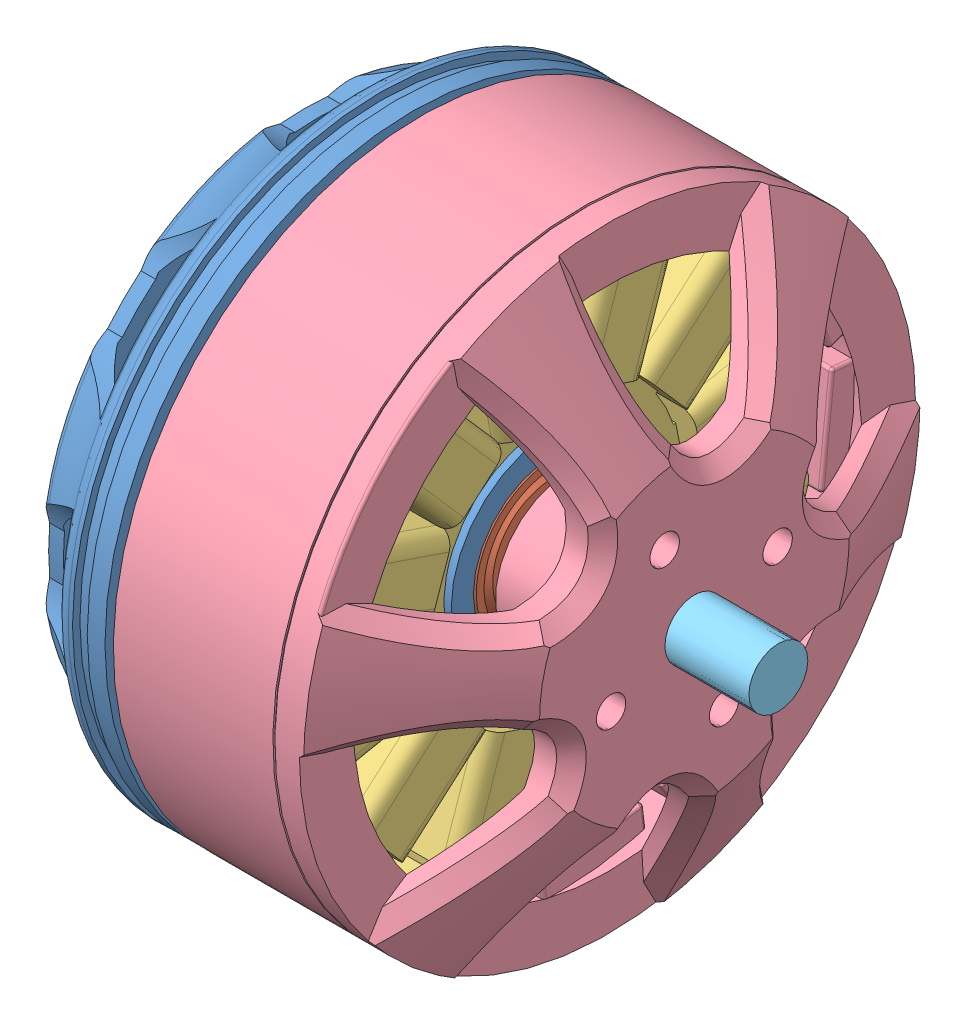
SolidWorks assembly 3508_low_res.SLDASM, configuration Default (file format 6000). Lengths in mm.
Overall size (33.5 53.4 53.4).
7 component instances, 6 part files, 12 mates.
Components (placement in the parent):
- stator-1: stator.SLDPRT [Default] at origin size (17.29 41.8 41.8)
- R1140ZZ bearing-1: R1140ZZ bearing.SLDPRT [Default] at (2 0 0) x (1 0 0) z (0 -0.171548 0.985176) size (4 11 11)
- R1140ZZ bearing-2: R1140ZZ bearing.SLDPRT [Default] at (15 0 0) x (1 0 0) z (0 -0.050794 0.998709) size (4 11 11)
- coil_green_low_res-1: coil_green_low_res.SLDPRT [Default] at (16.5 0 0) x (0 0.946955 -0.321366) z (0 0.321366 0.946955) size (36 11 36)
- bell-1: bell.SLDPRT [Default] at (26.5 0 0) x (1 0 0) z (0 -0.335291 0.942115) size (18.53 41.8 41.8)
- axle-1: axle.SLDPRT [Default] at (-1.3 0 0) x (0 -1 0) z (0 0 1) size (4 33.5 4)
- circlip-1: circlip.SLDPRT [Default] at (-0.3 0 0) x (0 1 0) z (0 0 1) size (5 0.2 4.33)
Mates (geometry in assembly coordinates):
- Concentric1: concentric anti-aligned: cylinder of stator-1 through (0 0 0) axis (1 0 0) radius 5.5; cylinder of R1140ZZ bearing-1 through (2 0 0) axis (-1 0 0) radius 2
- Coincident1: coincident anti-aligned: plane of stator-1 through (4 0 0) normal (-1 0 0); plane of R1140ZZ bearing-1 through (4 0 0) normal (1 0 0)
- Concentric2: concentric aligned: cylinder of stator-1 through (0 0 0) axis (-1 0 0) radius 5.5; cylinder of R1140ZZ bearing-2 through (15 0 0) axis (-1 0 0) radius 5.5
- Coincident2: coincident anti-aligned: plane of stator-1 through (13 0 0) normal (1 0 0); plane of R1140ZZ bearing-2 through (13 0 0) normal (-1 0 0)
- Concentric3: concentric anti-aligned: cylinder of stator-1 through (0 0 0) axis (-1 0 0) radius 7; cylinder of coil_green_low_res-1 through (8.5 0 0) axis (1 0 0) radius 7
- Coincident3: coincident anti-aligned: plane of stator-1 through (8.5 0 0) normal (1 0 0); plane of coil_green_low_res-1 through (8.5 0 0) normal (-1 0 0)
- Concentric4: concentric aligned: cylinder of stator-1 through (0 0 0) axis (-1 0 0) radius 2; cylinder of bell-1 through (23 0 0) axis (-1 0 0) radius 2
- Distance1: distance = 26.5 mm anti-aligned: plane of bell-1 through (26.5 1.8842 0.6706) normal (1 0 0); plane of stator-1 through (0 0 0) normal (-1 0 0)
- Concentric5: concentric aligned: cylinder of bell-1 through (23 0 0) axis (-1 0 0) radius 2; cylinder of axle-1 through (32.2 0 0) axis (-1 0 0) radius 2
- Distance2: distance = 32.2 mm anti-aligned: plane of axle-1 through (32.2 0 0) normal (1 0 0); plane of stator-1 through (0 0 0) normal (-1 0 0)
- Concentric6: concentric anti-aligned: cylinder of axle-1 through (-3 0 0) axis (-1 0 0) radius 1.5; cylinder of circlip-1 through (-0.5 0 0) axis (1 0 0) radius 1.5
- Coincident6: coincident anti-aligned: plane of axle-1 through (-0.3 0 0) normal (-1 0 0); plane of circlip-1 through (-0.3 0 0) normal (1 0 0)
